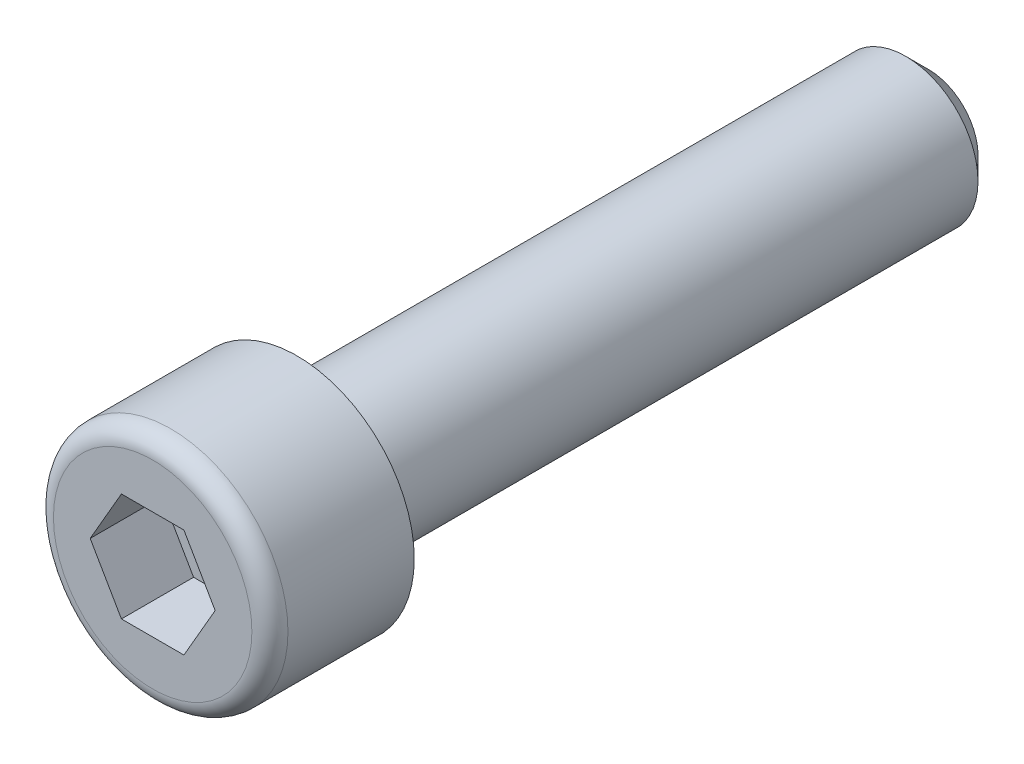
from build123d import *

# Parameters (mm, degrees)
ESQUISSE1_R             = 6.5
EXTRUSION1_DEPTH        = 8
CONG_1_R                = 1
ESQUISSE2_R             = 4
EXTRUSION2_DEPTH        = 35
CHANFREIN1_SIZE         = 1.25
ENL_V_MAT_EXTRU_1_DEPTH = 4


with BuildPart() as part:
    # Esquisse1 → Extrusion1 (new body)
    with BuildSketch(Plane.XY):
        Circle(ESQUISSE1_R)
    extrude(amount=EXTRUSION1_DEPTH)

    # Cong_1
    cong_1_edges = [part.edges().sort_by_distance(p)[0] for p in [
        (-6.5, 0, 8),
    ]]
    fillet(cong_1_edges, radius=CONG_1_R)

    # Esquisse2 → Extrusion2 (add)
    with BuildSketch(Plane(origin=(0, 0, 0), x_dir=(-1, 0, 0), z_dir=(0, 0, -1))):
        with Locations(Location((0, 0, 0), (0, 0, 180))):
            Circle(ESQUISSE2_R)
    extrude(amount=EXTRUSION2_DEPTH)

    # Chanfrein1
    chanfrein1_edges = [part.edges().sort_by_distance(p)[0] for p in [
        (-4, 0, -35),
    ]]
    chamfer(chanfrein1_edges, length=CHANFREIN1_SIZE)

    # Esquisse3 → Enl_v. mat.-Extru.1 (cut)
    with BuildSketch(Plane.XY.offset(8)):
        Polygon((3.464101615, 0), (1.732050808, 3), (-1.732050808, 3), (-3.464101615, 0), (-1.732050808, -3), (1.732050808, -3), align=None)
    extrude(amount=-ENL_V_MAT_EXTRU_1_DEPTH, mode=Mode.SUBTRACT)


solid = part.part
